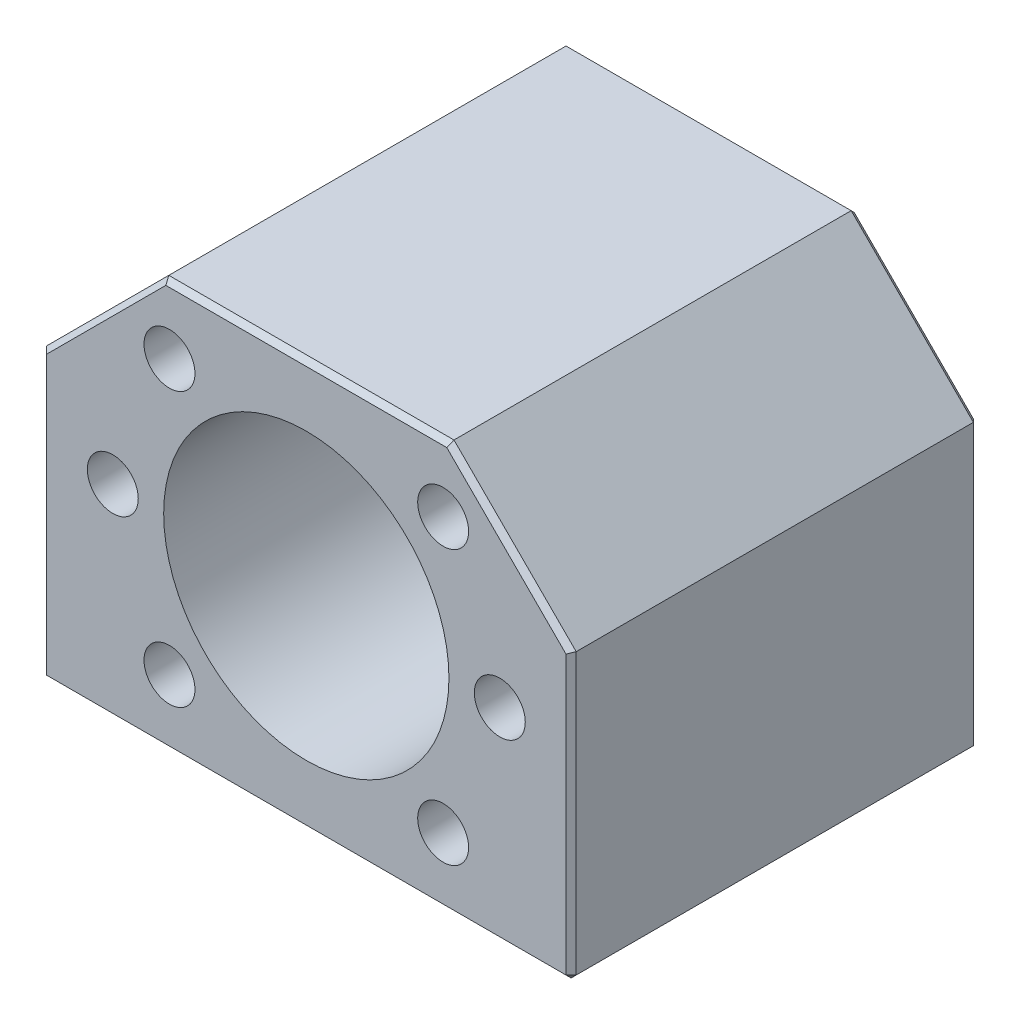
ISO-10303-21;
HEADER;
FILE_DESCRIPTION(('STEP AP214'),'2;1');
FILE_NAME('part.step','',(''),(''),'','','');
FILE_SCHEMA(('AUTOMOTIVE_DESIGN { 1 0 10303 214 1 1 1 1 }'));
ENDSEC;
DATA;
#1=APPLICATION_CONTEXT('core data for automotive mechanical design processes');
#2=APPLICATION_PROTOCOL_DEFINITION('international standard','automotive_design',2000,#1);
#3=PRODUCT_CONTEXT('',#1,'mechanical');
#4=PRODUCT('Part','Part','',(#3));
#5=PRODUCT_RELATED_PRODUCT_CATEGORY('part','',(#4));
#6=PRODUCT_DEFINITION_FORMATION('','',#4);
#7=PRODUCT_DEFINITION_CONTEXT('part definition',#1,'design');
#8=PRODUCT_DEFINITION('design','',#6,#7);
#9=PRODUCT_DEFINITION_SHAPE('','',#8);
#10=(LENGTH_UNIT() NAMED_UNIT(*) SI_UNIT(.MILLI.,.METRE.));
#11=(NAMED_UNIT(*) PLANE_ANGLE_UNIT() SI_UNIT($,.RADIAN.));
#12=(NAMED_UNIT(*) SI_UNIT($,.STERADIAN.) SOLID_ANGLE_UNIT());
#13=UNCERTAINTY_MEASURE_WITH_UNIT(LENGTH_MEASURE(1.E-05),#10,'distance_accuracy_value','');
#14=(GEOMETRIC_REPRESENTATION_CONTEXT(3) GLOBAL_UNCERTAINTY_ASSIGNED_CONTEXT((#13)) GLOBAL_UNIT_ASSIGNED_CONTEXT((#10,
#11,#12)) REPRESENTATION_CONTEXT('',''));
#15=CARTESIAN_POINT('',(0.,0.,0.));
#16=DIRECTION('',(0.,0.,1.));
#17=DIRECTION('',(1.,0.,0.));
#18=AXIS2_PLACEMENT_3D('',#15,#16,#17);
#19=CARTESIAN_POINT('',(-13.,19.75,-39.75));
#20=DIRECTION('',(0.,0.707106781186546,-0.707106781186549));
#21=DIRECTION('',(-1.,0.,0.));
#22=AXIS2_PLACEMENT_3D('',#19,#20,#21);
#23=PLANE('',#22);
#24=DIRECTION('',(-1.,0.,0.));
#25=VECTOR('',#24,1.);
#26=CARTESIAN_POINT('',(-13.,19.5,-40.));
#27=LINE('',#26,#25);
#28=CARTESIAN_POINT('',(13.7928932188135,19.5,-40.));
#29=VERTEX_POINT('',#28);
#30=CARTESIAN_POINT('',(-13.7928932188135,19.5,-40.));
#31=VERTEX_POINT('',#30);
#32=EDGE_CURVE('E9',#29,#31,#27,.T.);
#33=ORIENTED_EDGE('',*,*,#32,.T.);
#34=DIRECTION('',(-0.281084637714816,0.67859834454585,0.678598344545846));
#35=VECTOR('',#34,1.);
#36=CARTESIAN_POINT('',(-13.7928932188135,19.5,-40.));
#37=LINE('',#36,#35);
#38=CARTESIAN_POINT('',(-14.,20.,-39.5));
#39=VERTEX_POINT('',#38);
#40=EDGE_CURVE('E26',#31,#39,#37,.T.);
#41=ORIENTED_EDGE('',*,*,#40,.T.);
#42=DIRECTION('',(1.,0.,0.));
#43=VECTOR('',#42,1.);
#44=CARTESIAN_POINT('',(-13.,20.,-39.5));
#45=LINE('',#44,#43);
#46=CARTESIAN_POINT('',(14.,20.,-39.5));
#47=VERTEX_POINT('',#46);
#48=EDGE_CURVE('E500',#39,#47,#45,.T.);
#49=ORIENTED_EDGE('',*,*,#48,.T.);
#50=DIRECTION('',(0.281084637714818,0.678598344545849,0.678598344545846));
#51=VECTOR('',#50,1.);
#52=CARTESIAN_POINT('',(13.7928932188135,19.5,-40.));
#53=LINE('',#52,#51);
#54=EDGE_CURVE('E425',#29,#47,#53,.T.);
#55=ORIENTED_EDGE('',*,*,#54,.F.);
#56=EDGE_LOOP('',(#33,#41,#49,#55));
#57=FACE_BOUND('',#56,.T.);
#58=ADVANCED_FACE('F15',(#57),#23,.T.);
#59=CARTESIAN_POINT('',(-13.,19.75,-0.25));
#60=DIRECTION('',(0.,0.707106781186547,0.707106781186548));
#61=DIRECTION('',(1.,0.,0.));
#62=AXIS2_PLACEMENT_3D('',#59,#60,#61);
#63=PLANE('',#62);
#64=DIRECTION('',(1.,0.,0.));
#65=VECTOR('',#64,1.);
#66=CARTESIAN_POINT('',(-13.,19.5,0.));
#67=LINE('',#66,#65);
#68=CARTESIAN_POINT('',(-13.7928932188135,19.5,0.));
#69=VERTEX_POINT('',#68);
#70=CARTESIAN_POINT('',(13.7928932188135,19.5,0.));
#71=VERTEX_POINT('',#70);
#72=EDGE_CURVE('E458',#69,#71,#67,.T.);
#73=ORIENTED_EDGE('',*,*,#72,.T.);
#74=DIRECTION('',(0.281084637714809,0.678598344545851,-0.678598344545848));
#75=VECTOR('',#74,1.);
#76=CARTESIAN_POINT('',(13.7928932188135,19.5,0.));
#77=LINE('',#76,#75);
#78=CARTESIAN_POINT('',(14.,20.,-0.5));
#79=VERTEX_POINT('',#78);
#80=EDGE_CURVE('E454',#71,#79,#77,.T.);
#81=ORIENTED_EDGE('',*,*,#80,.T.);
#82=DIRECTION('',(-1.,0.,0.));
#83=VECTOR('',#82,1.);
#84=CARTESIAN_POINT('',(-13.,20.,-0.5));
#85=LINE('',#84,#83);
#86=CARTESIAN_POINT('',(-14.,20.,-0.5));
#87=VERTEX_POINT('',#86);
#88=EDGE_CURVE('E329',#79,#87,#85,.T.);
#89=ORIENTED_EDGE('',*,*,#88,.T.);
#90=DIRECTION('',(-0.281084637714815,0.678598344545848,-0.678598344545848));
#91=VECTOR('',#90,1.);
#92=CARTESIAN_POINT('',(-13.7928932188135,19.5,0.));
#93=LINE('',#92,#91);
#94=EDGE_CURVE('E357',#69,#87,#93,.T.);
#95=ORIENTED_EDGE('',*,*,#94,.F.);
#96=EDGE_LOOP('',(#73,#81,#89,#95));
#97=FACE_BOUND('',#96,.T.);
#98=ADVANCED_FACE('F1132',(#97),#63,.T.);
#99=CARTESIAN_POINT('',(-18.3232233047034,15.3232233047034,-39.75));
#100=DIRECTION('',(-0.5,0.5,-0.707106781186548));
#101=DIRECTION('',(-0.816496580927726,0.,0.577350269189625));
#102=AXIS2_PLACEMENT_3D('',#99,#100,#101);
#103=PLANE('',#102);
#104=DIRECTION('',(-0.707106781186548,-0.707106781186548,0.));
#105=VECTOR('',#104,1.);
#106=CARTESIAN_POINT('',(-18.1464466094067,15.1464466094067,-40.));
#107=LINE('',#106,#105);
#108=CARTESIAN_POINT('',(-25.5,7.79289321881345,-40.));
#109=VERTEX_POINT('',#108);
#110=EDGE_CURVE('E326',#31,#109,#107,.T.);
#111=ORIENTED_EDGE('',*,*,#110,.T.);
#112=DIRECTION('',(-0.678598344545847,0.281084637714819,0.678598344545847));
#113=VECTOR('',#112,1.);
#114=CARTESIAN_POINT('',(-25.5,7.79289321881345,-40.));
#115=LINE('',#114,#113);
#116=CARTESIAN_POINT('',(-26.,8.,-39.5));
#117=VERTEX_POINT('',#116);
#118=EDGE_CURVE('E330',#109,#117,#115,.T.);
#119=ORIENTED_EDGE('',*,*,#118,.T.);
#120=DIRECTION('',(0.707106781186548,0.707106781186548,0.));
#121=VECTOR('',#120,1.);
#122=CARTESIAN_POINT('',(-18.5,15.5,-39.5));
#123=LINE('',#122,#121);
#124=EDGE_CURVE('E434',#117,#39,#123,.T.);
#125=ORIENTED_EDGE('',*,*,#124,.T.);
#126=ORIENTED_EDGE('',*,*,#40,.F.);
#127=EDGE_LOOP('',(#111,#119,#125,#126));
#128=FACE_BOUND('',#127,.T.);
#129=ADVANCED_FACE('F696',(#128),#103,.T.);
#130=CARTESIAN_POINT('',(18.3232233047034,15.3232233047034,-0.25));
#131=DIRECTION('',(0.5,0.5,0.707106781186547));
#132=DIRECTION('',(0.707106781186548,-0.707106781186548,0.));
#133=AXIS2_PLACEMENT_3D('',#130,#131,#132);
#134=PLANE('',#133);
#135=DIRECTION('',(0.707106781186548,-0.707106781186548,0.));
#136=VECTOR('',#135,1.);
#137=CARTESIAN_POINT('',(18.1464466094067,15.1464466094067,0.));
#138=LINE('',#137,#136);
#139=CARTESIAN_POINT('',(25.5,7.79289321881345,0.));
#140=VERTEX_POINT('',#139);
#141=EDGE_CURVE('E430',#71,#140,#138,.T.);
#142=ORIENTED_EDGE('',*,*,#141,.T.);
#143=DIRECTION('',(0.678598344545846,0.281084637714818,-0.678598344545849));
#144=VECTOR('',#143,1.);
#145=CARTESIAN_POINT('',(25.5,7.79289321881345,0.));
#146=LINE('',#145,#144);
#147=CARTESIAN_POINT('',(26.,8.,-0.5));
#148=VERTEX_POINT('',#147);
#149=EDGE_CURVE('E435',#140,#148,#146,.T.);
#150=ORIENTED_EDGE('',*,*,#149,.T.);
#151=DIRECTION('',(-0.707106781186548,0.707106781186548,0.));
#152=VECTOR('',#151,1.);
#153=CARTESIAN_POINT('',(18.5,15.5,-0.5));
#154=LINE('',#153,#152);
#155=EDGE_CURVE('E285',#148,#79,#154,.T.);
#156=ORIENTED_EDGE('',*,*,#155,.T.);
#157=ORIENTED_EDGE('',*,*,#80,.F.);
#158=EDGE_LOOP('',(#142,#150,#156,#157));
#159=FACE_BOUND('',#158,.T.);
#160=ADVANCED_FACE('F1121',(#159),#134,.T.);
#161=CARTESIAN_POINT('',(25.5,-20.,-39.5));
#162=DIRECTION('',(0.577350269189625,-0.577350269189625,-0.577350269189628));
#163=DIRECTION('',(0.,-0.70710678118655,0.707106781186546));
#164=AXIS2_PLACEMENT_3D('',#161,#162,#163);
#165=PLANE('',#164);
#166=DIRECTION('',(-0.707106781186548,0.,-0.707106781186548));
#167=VECTOR('',#166,1.);
#168=CARTESIAN_POINT('',(26.,-19.5,-39.5));
#169=LINE('',#168,#167);
#170=CARTESIAN_POINT('',(26.,-19.5,-39.5));
#171=VERTEX_POINT('',#170);
#172=CARTESIAN_POINT('',(25.5,-19.5,-40.));
#173=VERTEX_POINT('',#172);
#174=EDGE_CURVE('E413',#171,#173,#169,.T.);
#175=ORIENTED_EDGE('',*,*,#174,.F.);
#176=DIRECTION('',(0.707106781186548,0.707106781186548,0.));
#177=VECTOR('',#176,1.);
#178=CARTESIAN_POINT('',(25.5,-20.,-39.5));
#179=LINE('',#178,#177);
#180=CARTESIAN_POINT('',(25.5,-20.,-39.5));
#181=VERTEX_POINT('',#180);
#182=EDGE_CURVE('E661',#181,#171,#179,.T.);
#183=ORIENTED_EDGE('',*,*,#182,.F.);
#184=DIRECTION('',(0.,-0.707106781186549,0.707106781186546));
#185=VECTOR('',#184,1.);
#186=CARTESIAN_POINT('',(25.5,-19.5,-40.));
#187=LINE('',#186,#185);
#188=EDGE_CURVE('E320',#173,#181,#187,.T.);
#189=ORIENTED_EDGE('',*,*,#188,.F.);
#190=EDGE_LOOP('',(#175,#183,#189));
#191=FACE_BOUND('',#190,.T.);
#192=ADVANCED_FACE('F666',(#191),#165,.T.);
#193=CARTESIAN_POINT('',(-26.,-19.5,-39.5));
#194=DIRECTION('',(-0.577350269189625,-0.577350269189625,-0.577350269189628));
#195=DIRECTION('',(0.,-0.70710678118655,0.707106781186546));
#196=AXIS2_PLACEMENT_3D('',#193,#194,#195);
#197=PLANE('',#196);
#198=DIRECTION('',(0.,0.707106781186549,-0.707106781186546));
#199=VECTOR('',#198,1.);
#200=CARTESIAN_POINT('',(-25.5,-20.,-39.5));
#201=LINE('',#200,#199);
#202=CARTESIAN_POINT('',(-25.5,-20.,-39.5));
#203=VERTEX_POINT('',#202);
#204=CARTESIAN_POINT('',(-25.5,-19.5,-40.));
#205=VERTEX_POINT('',#204);
#206=EDGE_CURVE('E319',#203,#205,#201,.T.);
#207=ORIENTED_EDGE('',*,*,#206,.F.);
#208=DIRECTION('',(0.707106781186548,-0.707106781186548,0.));
#209=VECTOR('',#208,1.);
#210=CARTESIAN_POINT('',(-26.,-19.5,-39.5));
#211=LINE('',#210,#209);
#212=CARTESIAN_POINT('',(-26.,-19.5,-39.5));
#213=VERTEX_POINT('',#212);
#214=EDGE_CURVE('E379',#213,#203,#211,.T.);
#215=ORIENTED_EDGE('',*,*,#214,.F.);
#216=DIRECTION('',(-0.707106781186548,0.,0.707106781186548));
#217=VECTOR('',#216,1.);
#218=CARTESIAN_POINT('',(-25.5,-19.5,-40.));
#219=LINE('',#218,#217);
#220=EDGE_CURVE('E501',#205,#213,#219,.T.);
#221=ORIENTED_EDGE('',*,*,#220,.F.);
#222=EDGE_LOOP('',(#207,#215,#221));
#223=FACE_BOUND('',#222,.T.);
#224=ADVANCED_FACE('F681',(#223),#197,.T.);
#225=CARTESIAN_POINT('',(25.5,-20.,-0.5));
#226=DIRECTION('',(0.577350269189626,-0.577350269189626,0.577350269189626));
#227=DIRECTION('',(0.,-0.707106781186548,-0.707106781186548));
#228=AXIS2_PLACEMENT_3D('',#225,#226,#227);
#229=PLANE('',#228);
#230=DIRECTION('',(0.707106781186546,0.,-0.707106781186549));
#231=VECTOR('',#230,1.);
#232=CARTESIAN_POINT('',(25.5,-19.5,0.));
#233=LINE('',#232,#231);
#234=CARTESIAN_POINT('',(25.5,-19.5,0.));
#235=VERTEX_POINT('',#234);
#236=CARTESIAN_POINT('',(26.,-19.5,-0.5));
#237=VERTEX_POINT('',#236);
#238=EDGE_CURVE('E343',#235,#237,#233,.T.);
#239=ORIENTED_EDGE('',*,*,#238,.F.);
#240=DIRECTION('',(0.,0.707106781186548,0.707106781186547));
#241=VECTOR('',#240,1.);
#242=CARTESIAN_POINT('',(25.5,-20.,-0.5));
#243=LINE('',#242,#241);
#244=CARTESIAN_POINT('',(25.5,-20.,-0.5));
#245=VERTEX_POINT('',#244);
#246=EDGE_CURVE('E509',#245,#235,#243,.T.);
#247=ORIENTED_EDGE('',*,*,#246,.F.);
#248=DIRECTION('',(-0.707106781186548,-0.707106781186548,0.));
#249=VECTOR('',#248,1.);
#250=CARTESIAN_POINT('',(26.,-19.5,-0.5));
#251=LINE('',#250,#249);
#252=EDGE_CURVE('E519',#237,#245,#251,.T.);
#253=ORIENTED_EDGE('',*,*,#252,.F.);
#254=EDGE_LOOP('',(#239,#247,#253));
#255=FACE_BOUND('',#254,.T.);
#256=ADVANCED_FACE('F1194',(#255),#229,.T.);
#257=CARTESIAN_POINT('',(-26.,-19.5,-0.5));
#258=DIRECTION('',(-0.577350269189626,-0.577350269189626,0.577350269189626));
#259=DIRECTION('',(-0.707106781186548,0.707106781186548,0.));
#260=AXIS2_PLACEMENT_3D('',#257,#258,#259);
#261=PLANE('',#260);
#262=DIRECTION('',(0.,-0.707106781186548,-0.707106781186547));
#263=VECTOR('',#262,1.);
#264=CARTESIAN_POINT('',(-25.5,-19.5,0.));
#265=LINE('',#264,#263);
#266=CARTESIAN_POINT('',(-25.5,-19.5,0.));
#267=VERTEX_POINT('',#266);
#268=CARTESIAN_POINT('',(-25.5,-20.,-0.5));
#269=VERTEX_POINT('',#268);
#270=EDGE_CURVE('E19',#267,#269,#265,.T.);
#271=ORIENTED_EDGE('',*,*,#270,.F.);
#272=DIRECTION('',(0.707106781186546,0.,0.707106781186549));
#273=VECTOR('',#272,1.);
#274=CARTESIAN_POINT('',(-26.,-19.5,-0.5));
#275=LINE('',#274,#273);
#276=CARTESIAN_POINT('',(-26.,-19.5,-0.5));
#277=VERTEX_POINT('',#276);
#278=EDGE_CURVE('E337',#277,#267,#275,.T.);
#279=ORIENTED_EDGE('',*,*,#278,.F.);
#280=DIRECTION('',(-0.707106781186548,0.707106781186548,0.));
#281=VECTOR('',#280,1.);
#282=CARTESIAN_POINT('',(-25.5,-20.,-0.5));
#283=LINE('',#282,#281);
#284=EDGE_CURVE('E186',#269,#277,#283,.T.);
#285=ORIENTED_EDGE('',*,*,#284,.F.);
#286=EDGE_LOOP('',(#271,#279,#285));
#287=FACE_BOUND('',#286,.T.);
#288=ADVANCED_FACE('F1190',(#287),#261,.T.);
#289=CARTESIAN_POINT('',(-25.75,-10.,-0.25));
#290=DIRECTION('',(-0.707106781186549,0.,0.707106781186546));
#291=DIRECTION('',(0.,1.,0.));
#292=AXIS2_PLACEMENT_3D('',#289,#290,#291);
#293=PLANE('',#292);
#294=DIRECTION('',(0.,-1.,0.));
#295=VECTOR('',#294,1.);
#296=CARTESIAN_POINT('',(-26.,-10.,-0.5));
#297=LINE('',#296,#295);
#298=CARTESIAN_POINT('',(-26.,8.,-0.5));
#299=VERTEX_POINT('',#298);
#300=EDGE_CURVE('E341',#299,#277,#297,.T.);
#301=ORIENTED_EDGE('',*,*,#300,.T.);
#302=ORIENTED_EDGE('',*,*,#278,.T.);
#303=DIRECTION('',(0.,1.,0.));
#304=VECTOR('',#303,1.);
#305=CARTESIAN_POINT('',(-25.5,-10.,0.));
#306=LINE('',#305,#304);
#307=CARTESIAN_POINT('',(-25.5,7.79289321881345,0.));
#308=VERTEX_POINT('',#307);
#309=EDGE_CURVE('E342',#267,#308,#306,.T.);
#310=ORIENTED_EDGE('',*,*,#309,.T.);
#311=DIRECTION('',(-0.678598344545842,0.281084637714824,-0.678598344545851));
#312=VECTOR('',#311,1.);
#313=CARTESIAN_POINT('',(-25.5,7.79289321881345,0.));
#314=LINE('',#313,#312);
#315=EDGE_CURVE('E466',#308,#299,#314,.T.);
#316=ORIENTED_EDGE('',*,*,#315,.T.);
#317=EDGE_LOOP('',(#301,#302,#310,#316));
#318=FACE_BOUND('',#317,.T.);
#319=ADVANCED_FACE('F1193',(#318),#293,.T.);
#320=CARTESIAN_POINT('',(-25.75,-19.75,0.));
#321=DIRECTION('',(-0.707106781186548,-0.707106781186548,0.));
#322=DIRECTION('',(-0.707106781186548,0.707106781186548,0.));
#323=AXIS2_PLACEMENT_3D('',#320,#321,#322);
#324=PLANE('',#323);
#325=ORIENTED_EDGE('',*,*,#214,.T.);
#326=DIRECTION('',(0.,0.,1.));
#327=VECTOR('',#326,1.);
#328=CARTESIAN_POINT('',(-25.5,-20.,0.));
#329=LINE('',#328,#327);
#330=EDGE_CURVE('E377',#203,#269,#329,.T.);
#331=ORIENTED_EDGE('',*,*,#330,.T.);
#332=ORIENTED_EDGE('',*,*,#284,.T.);
#333=DIRECTION('',(0.,0.,-1.));
#334=VECTOR('',#333,1.);
#335=CARTESIAN_POINT('',(-26.,-19.5,0.));
#336=LINE('',#335,#334);
#337=EDGE_CURVE('E506',#277,#213,#336,.T.);
#338=ORIENTED_EDGE('',*,*,#337,.T.);
#339=EDGE_LOOP('',(#325,#331,#332,#338));
#340=FACE_BOUND('',#339,.T.);
#341=ADVANCED_FACE('F676',(#340),#324,.T.);
#342=CARTESIAN_POINT('',(13.,-19.75,-0.25));
#343=DIRECTION('',(0.,-0.707106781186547,0.707106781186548));
#344=DIRECTION('',(-1.,0.,0.));
#345=AXIS2_PLACEMENT_3D('',#342,#343,#344);
#346=PLANE('',#345);
#347=ORIENTED_EDGE('',*,*,#246,.T.);
#348=DIRECTION('',(-1.,0.,0.));
#349=VECTOR('',#348,1.);
#350=CARTESIAN_POINT('',(13.,-19.5,0.));
#351=LINE('',#350,#349);
#352=EDGE_CURVE('E544',#235,#267,#351,.T.);
#353=ORIENTED_EDGE('',*,*,#352,.T.);
#354=ORIENTED_EDGE('',*,*,#270,.T.);
#355=DIRECTION('',(1.,0.,0.));
#356=VECTOR('',#355,1.);
#357=CARTESIAN_POINT('',(13.,-20.,-0.5));
#358=LINE('',#357,#356);
#359=EDGE_CURVE('E669',#269,#245,#358,.T.);
#360=ORIENTED_EDGE('',*,*,#359,.T.);
#361=EDGE_LOOP('',(#347,#353,#354,#360));
#362=FACE_BOUND('',#361,.T.);
#363=ADVANCED_FACE('F1206',(#362),#346,.T.);
#364=CARTESIAN_POINT('',(25.75,-19.75,0.));
#365=DIRECTION('',(0.707106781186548,-0.707106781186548,0.));
#366=DIRECTION('',(0.,0.,-1.));
#367=AXIS2_PLACEMENT_3D('',#364,#365,#366);
#368=PLANE('',#367);
#369=ORIENTED_EDGE('',*,*,#182,.T.);
#370=DIRECTION('',(0.,0.,1.));
#371=VECTOR('',#370,1.);
#372=CARTESIAN_POINT('',(26.,-19.5,0.));
#373=LINE('',#372,#371);
#374=EDGE_CURVE('E571',#171,#237,#373,.T.);
#375=ORIENTED_EDGE('',*,*,#374,.T.);
#376=ORIENTED_EDGE('',*,*,#252,.T.);
#377=DIRECTION('',(0.,0.,-1.));
#378=VECTOR('',#377,1.);
#379=CARTESIAN_POINT('',(25.5,-20.,0.));
#380=LINE('',#379,#378);
#381=EDGE_CURVE('E486',#245,#181,#380,.T.);
#382=ORIENTED_EDGE('',*,*,#381,.T.);
#383=EDGE_LOOP('',(#369,#375,#376,#382));
#384=FACE_BOUND('',#383,.T.);
#385=ADVANCED_FACE('F659',(#384),#368,.T.);
#386=CARTESIAN_POINT('',(25.75,10.,-0.25));
#387=DIRECTION('',(0.707106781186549,0.,0.707106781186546));
#388=DIRECTION('',(0.,-1.,0.));
#389=AXIS2_PLACEMENT_3D('',#386,#387,#388);
#390=PLANE('',#389);
#391=DIRECTION('',(0.,-1.,0.));
#392=VECTOR('',#391,1.);
#393=CARTESIAN_POINT('',(25.5,10.,0.));
#394=LINE('',#393,#392);
#395=EDGE_CURVE('E346',#140,#235,#394,.T.);
#396=ORIENTED_EDGE('',*,*,#395,.T.);
#397=ORIENTED_EDGE('',*,*,#238,.T.);
#398=DIRECTION('',(0.,1.,0.));
#399=VECTOR('',#398,1.);
#400=CARTESIAN_POINT('',(26.,10.,-0.5));
#401=LINE('',#400,#399);
#402=EDGE_CURVE('E347',#237,#148,#401,.T.);
#403=ORIENTED_EDGE('',*,*,#402,.T.);
#404=ORIENTED_EDGE('',*,*,#149,.F.);
#405=EDGE_LOOP('',(#396,#397,#403,#404));
#406=FACE_BOUND('',#405,.T.);
#407=ADVANCED_FACE('F1488',(#406),#390,.T.);
#408=CARTESIAN_POINT('',(-25.75,-10.,-39.75));
#409=DIRECTION('',(-0.707106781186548,0.,-0.707106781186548));
#410=DIRECTION('',(-0.707106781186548,0.,0.707106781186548));
#411=AXIS2_PLACEMENT_3D('',#408,#409,#410);
#412=PLANE('',#411);
#413=DIRECTION('',(0.,-1.,0.));
#414=VECTOR('',#413,1.);
#415=CARTESIAN_POINT('',(-25.5,-10.,-40.));
#416=LINE('',#415,#414);
#417=EDGE_CURVE('E405',#109,#205,#416,.T.);
#418=ORIENTED_EDGE('',*,*,#417,.T.);
#419=ORIENTED_EDGE('',*,*,#220,.T.);
#420=DIRECTION('',(0.,1.,0.));
#421=VECTOR('',#420,1.);
#422=CARTESIAN_POINT('',(-26.,-10.,-39.5));
#423=LINE('',#422,#421);
#424=EDGE_CURVE('E505',#213,#117,#423,.T.);
#425=ORIENTED_EDGE('',*,*,#424,.T.);
#426=ORIENTED_EDGE('',*,*,#118,.F.);
#427=EDGE_LOOP('',(#418,#419,#425,#426));
#428=FACE_BOUND('',#427,.T.);
#429=ADVANCED_FACE('F690',(#428),#412,.T.);
#430=CARTESIAN_POINT('',(13.,-19.75,-39.75));
#431=DIRECTION('',(0.,-0.707106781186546,-0.707106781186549));
#432=DIRECTION('',(0.,-0.707106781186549,0.707106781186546));
#433=AXIS2_PLACEMENT_3D('',#430,#431,#432);
#434=PLANE('',#433);
#435=ORIENTED_EDGE('',*,*,#206,.T.);
#436=DIRECTION('',(1.,0.,0.));
#437=VECTOR('',#436,1.);
#438=CARTESIAN_POINT('',(13.,-19.5,-40.));
#439=LINE('',#438,#437);
#440=EDGE_CURVE('E315',#205,#173,#439,.T.);
#441=ORIENTED_EDGE('',*,*,#440,.T.);
#442=ORIENTED_EDGE('',*,*,#188,.T.);
#443=DIRECTION('',(-1.,0.,0.));
#444=VECTOR('',#443,1.);
#445=CARTESIAN_POINT('',(13.,-20.,-39.5));
#446=LINE('',#445,#444);
#447=EDGE_CURVE('E459',#181,#203,#446,.T.);
#448=ORIENTED_EDGE('',*,*,#447,.T.);
#449=EDGE_LOOP('',(#435,#441,#442,#448));
#450=FACE_BOUND('',#449,.T.);
#451=ADVANCED_FACE('F648',(#450),#434,.T.);
#452=CARTESIAN_POINT('',(-18.3232233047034,15.3232233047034,-0.25));
#453=DIRECTION('',(-0.5,0.5,0.707106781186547));
#454=DIRECTION('',(0.707106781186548,0.707106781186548,0.));
#455=AXIS2_PLACEMENT_3D('',#452,#453,#454);
#456=PLANE('',#455);
#457=DIRECTION('',(-0.707106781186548,-0.707106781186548,0.));
#458=VECTOR('',#457,1.);
#459=CARTESIAN_POINT('',(-18.5,15.5,-0.5));
#460=LINE('',#459,#458);
#461=EDGE_CURVE('E356',#87,#299,#460,.T.);
#462=ORIENTED_EDGE('',*,*,#461,.T.);
#463=ORIENTED_EDGE('',*,*,#315,.F.);
#464=DIRECTION('',(0.707106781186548,0.707106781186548,0.));
#465=VECTOR('',#464,1.);
#466=CARTESIAN_POINT('',(-18.1464466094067,15.1464466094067,0.));
#467=LINE('',#466,#465);
#468=EDGE_CURVE('E352',#308,#69,#467,.T.);
#469=ORIENTED_EDGE('',*,*,#468,.T.);
#470=ORIENTED_EDGE('',*,*,#94,.T.);
#471=EDGE_LOOP('',(#462,#463,#469,#470));
#472=FACE_BOUND('',#471,.T.);
#473=ADVANCED_FACE('F1471',(#472),#456,.T.);
#474=CARTESIAN_POINT('',(25.75,10.,-39.75));
#475=DIRECTION('',(0.707106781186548,0.,-0.707106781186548));
#476=DIRECTION('',(0.,-1.,0.));
#477=AXIS2_PLACEMENT_3D('',#474,#475,#476);
#478=PLANE('',#477);
#479=DIRECTION('',(0.,-1.,0.));
#480=VECTOR('',#479,1.);
#481=CARTESIAN_POINT('',(26.,10.,-39.5));
#482=LINE('',#481,#480);
#483=CARTESIAN_POINT('',(26.,8.,-39.5));
#484=VERTEX_POINT('',#483);
#485=EDGE_CURVE('E376',#484,#171,#482,.T.);
#486=ORIENTED_EDGE('',*,*,#485,.T.);
#487=ORIENTED_EDGE('',*,*,#174,.T.);
#488=DIRECTION('',(0.,1.,0.));
#489=VECTOR('',#488,1.);
#490=CARTESIAN_POINT('',(25.5,10.,-40.));
#491=LINE('',#490,#489);
#492=CARTESIAN_POINT('',(25.5,7.79289321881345,-40.));
#493=VERTEX_POINT('',#492);
#494=EDGE_CURVE('E417',#173,#493,#491,.T.);
#495=ORIENTED_EDGE('',*,*,#494,.T.);
#496=DIRECTION('',(0.678598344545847,0.281084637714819,0.678598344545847));
#497=VECTOR('',#496,1.);
#498=CARTESIAN_POINT('',(25.5,7.79289321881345,-40.));
#499=LINE('',#498,#497);
#500=EDGE_CURVE('E385',#493,#484,#499,.T.);
#501=ORIENTED_EDGE('',*,*,#500,.T.);
#502=EDGE_LOOP('',(#486,#487,#495,#501));
#503=FACE_BOUND('',#502,.T.);
#504=ADVANCED_FACE('F1145',(#503),#478,.T.);
#505=CARTESIAN_POINT('',(18.3232233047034,15.3232233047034,-39.75));
#506=DIRECTION('',(0.5,0.5,-0.707106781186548));
#507=DIRECTION('',(0.,-0.816496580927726,-0.577350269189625));
#508=AXIS2_PLACEMENT_3D('',#505,#506,#507);
#509=PLANE('',#508);
#510=DIRECTION('',(0.707106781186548,-0.707106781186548,0.));
#511=VECTOR('',#510,1.);
#512=CARTESIAN_POINT('',(18.5,15.5,-39.5));
#513=LINE('',#512,#511);
#514=EDGE_CURVE('E381',#47,#484,#513,.T.);
#515=ORIENTED_EDGE('',*,*,#514,.T.);
#516=ORIENTED_EDGE('',*,*,#500,.F.);
#517=DIRECTION('',(-0.707106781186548,0.707106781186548,0.));
#518=VECTOR('',#517,1.);
#519=CARTESIAN_POINT('',(18.1464466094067,15.1464466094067,-40.));
#520=LINE('',#519,#518);
#521=EDGE_CURVE('E386',#493,#29,#520,.T.);
#522=ORIENTED_EDGE('',*,*,#521,.T.);
#523=ORIENTED_EDGE('',*,*,#54,.T.);
#524=EDGE_LOOP('',(#515,#516,#522,#523));
#525=FACE_BOUND('',#524,.T.);
#526=ADVANCED_FACE('F1142',(#525),#509,.T.);
#527=CARTESIAN_POINT('',(-20.,14.,0.));
#528=DIRECTION('',(-0.707106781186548,0.707106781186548,0.));
#529=DIRECTION('',(0.,0.,1.));
#530=AXIS2_PLACEMENT_3D('',#527,#528,#529);
#531=PLANE('',#530);
#532=ORIENTED_EDGE('',*,*,#461,.F.);
#533=DIRECTION('',(0.,0.,-1.));
#534=VECTOR('',#533,1.);
#535=CARTESIAN_POINT('',(-14.,20.,0.));
#536=LINE('',#535,#534);
#537=EDGE_CURVE('E429',#87,#39,#536,.T.);
#538=ORIENTED_EDGE('',*,*,#537,.T.);
#539=ORIENTED_EDGE('',*,*,#124,.F.);
#540=DIRECTION('',(0.,0.,1.));
#541=VECTOR('',#540,1.);
#542=CARTESIAN_POINT('',(-26.,8.,0.));
#543=LINE('',#542,#541);
#544=EDGE_CURVE('E532',#117,#299,#543,.T.);
#545=ORIENTED_EDGE('',*,*,#544,.T.);
#546=EDGE_LOOP('',(#532,#538,#539,#545));
#547=FACE_BOUND('',#546,.T.);
#548=ADVANCED_FACE('F693',(#547),#531,.T.);
#549=CARTESIAN_POINT('',(-26.,20.,0.));
#550=DIRECTION('',(0.,1.,0.));
#551=DIRECTION('',(1.,0.,0.));
#552=AXIS2_PLACEMENT_3D('',#549,#550,#551);
#553=PLANE('',#552);
#554=ORIENTED_EDGE('',*,*,#88,.F.);
#555=DIRECTION('',(0.,0.,1.));
#556=VECTOR('',#555,1.);
#557=CARTESIAN_POINT('',(14.,20.,0.));
#558=LINE('',#557,#556);
#559=EDGE_CURVE('E411',#47,#79,#558,.T.);
#560=ORIENTED_EDGE('',*,*,#559,.F.);
#561=ORIENTED_EDGE('',*,*,#48,.F.);
#562=ORIENTED_EDGE('',*,*,#537,.F.);
#563=EDGE_LOOP('',(#554,#560,#561,#562));
#564=FACE_BOUND('',#563,.T.);
#565=ADVANCED_FACE('F1128',(#564),#553,.T.);
#566=CARTESIAN_POINT('',(20.,14.,0.));
#567=DIRECTION('',(0.707106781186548,0.707106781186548,0.));
#568=DIRECTION('',(0.,0.,-1.));
#569=AXIS2_PLACEMENT_3D('',#566,#567,#568);
#570=PLANE('',#569);
#571=ORIENTED_EDGE('',*,*,#155,.F.);
#572=DIRECTION('',(0.,0.,-1.));
#573=VECTOR('',#572,1.);
#574=CARTESIAN_POINT('',(26.,8.,0.));
#575=LINE('',#574,#573);
#576=EDGE_CURVE('E536',#148,#484,#575,.T.);
#577=ORIENTED_EDGE('',*,*,#576,.T.);
#578=ORIENTED_EDGE('',*,*,#514,.F.);
#579=ORIENTED_EDGE('',*,*,#559,.T.);
#580=EDGE_LOOP('',(#571,#577,#578,#579));
#581=FACE_BOUND('',#580,.T.);
#582=ADVANCED_FACE('F1136',(#581),#570,.T.);
#583=CARTESIAN_POINT('',(26.,20.,0.));
#584=DIRECTION('',(1.,0.,0.));
#585=DIRECTION('',(0.,1.,0.));
#586=AXIS2_PLACEMENT_3D('',#583,#584,#585);
#587=PLANE('',#586);
#588=ORIENTED_EDGE('',*,*,#402,.F.);
#589=ORIENTED_EDGE('',*,*,#374,.F.);
#590=ORIENTED_EDGE('',*,*,#485,.F.);
#591=ORIENTED_EDGE('',*,*,#576,.F.);
#592=EDGE_LOOP('',(#588,#589,#590,#591));
#593=FACE_BOUND('',#592,.T.);
#594=ADVANCED_FACE('F1197',(#593),#587,.T.);
#595=CARTESIAN_POINT('',(0.,0.,-40.));
#596=DIRECTION('',(0.,0.,-1.));
#597=DIRECTION('',(0.,-1.,0.));
#598=AXIS2_PLACEMENT_3D('',#595,#596,#597);
#599=PLANE('',#598);
#600=ORIENTED_EDGE('',*,*,#32,.F.);
#601=ORIENTED_EDGE('',*,*,#521,.F.);
#602=ORIENTED_EDGE('',*,*,#494,.F.);
#603=ORIENTED_EDGE('',*,*,#440,.F.);
#604=ORIENTED_EDGE('',*,*,#417,.F.);
#605=ORIENTED_EDGE('',*,*,#110,.F.);
#606=EDGE_LOOP('',(#600,#601,#602,#603,#604,#605));
#607=FACE_BOUND('',#606,.T.);
#608=CARTESIAN_POINT('',(0.,0.,-40.));
#609=DIRECTION('',(0.,0.,1.));
#610=DIRECTION('',(1.,0.,0.));
#611=AXIS2_PLACEMENT_3D('',#608,#609,#610);
#612=CIRCLE('',#611,14.005);
#613=CARTESIAN_POINT('',(-14.005,0.,-40.));
#614=VERTEX_POINT('',#613);
#615=EDGE_CURVE('E407',#614,#614,#612,.T.);
#616=ORIENTED_EDGE('',*,*,#615,.T.);
#617=EDGE_LOOP('',(#616));
#618=FACE_BOUND('',#617,.T.);
#619=ADVANCED_FACE('F701',(#607,#618),#599,.T.);
#620=CARTESIAN_POINT('',(0.,0.,0.));
#621=DIRECTION('',(0.,0.,1.));
#622=DIRECTION('',(1.,0.,0.));
#623=AXIS2_PLACEMENT_3D('',#620,#621,#622);
#624=PLANE('',#623);
#625=ORIENTED_EDGE('',*,*,#309,.F.);
#626=ORIENTED_EDGE('',*,*,#352,.F.);
#627=ORIENTED_EDGE('',*,*,#395,.F.);
#628=ORIENTED_EDGE('',*,*,#141,.F.);
#629=ORIENTED_EDGE('',*,*,#72,.F.);
#630=ORIENTED_EDGE('',*,*,#468,.F.);
#631=EDGE_LOOP('',(#625,#626,#627,#628,#629,#630));
#632=FACE_BOUND('',#631,.T.);
#633=CARTESIAN_POINT('',(0.,0.,0.));
#634=DIRECTION('',(0.,0.,-1.));
#635=DIRECTION('',(1.,0.,0.));
#636=AXIS2_PLACEMENT_3D('',#633,#634,#635);
#637=CIRCLE('',#636,14.005);
#638=CARTESIAN_POINT('',(14.005,0.,0.));
#639=VERTEX_POINT('',#638);
#640=CARTESIAN_POINT('',(-14.005,0.,0.));
#641=VERTEX_POINT('',#640);
#642=EDGE_CURVE('E412',#639,#641,#637,.T.);
#643=ORIENTED_EDGE('',*,*,#642,.T.);
#644=CARTESIAN_POINT('',(0.,0.,0.));
#645=DIRECTION('',(0.,0.,-1.));
#646=DIRECTION('',(1.,0.,0.));
#647=AXIS2_PLACEMENT_3D('',#644,#645,#646);
#648=CIRCLE('',#647,14.005);
#649=EDGE_CURVE('E523',#641,#639,#648,.T.);
#650=ORIENTED_EDGE('',*,*,#649,.T.);
#651=EDGE_LOOP('',(#643,#650));
#652=FACE_BOUND('',#651,.T.);
#653=CARTESIAN_POINT('',(-13.4350288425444,13.4350288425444,0.));
#654=DIRECTION('',(0.,0.,-1.));
#655=DIRECTION('',(1.,0.,0.));
#656=AXIS2_PLACEMENT_3D('',#653,#654,#655);
#657=CIRCLE('',#656,2.5);
#658=CARTESIAN_POINT('',(-10.9350288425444,13.4350288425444,0.));
#659=VERTEX_POINT('',#658);
#660=CARTESIAN_POINT('',(-15.9350288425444,13.4350288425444,0.));
#661=VERTEX_POINT('',#660);
#662=EDGE_CURVE('E578',#659,#661,#657,.T.);
#663=ORIENTED_EDGE('',*,*,#662,.T.);
#664=CARTESIAN_POINT('',(-13.4350288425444,13.4350288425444,0.));
#665=DIRECTION('',(0.,0.,-1.));
#666=DIRECTION('',(1.,0.,0.));
#667=AXIS2_PLACEMENT_3D('',#664,#665,#666);
#668=CIRCLE('',#667,2.5);
#669=EDGE_CURVE('E557',#661,#659,#668,.T.);
#670=ORIENTED_EDGE('',*,*,#669,.T.);
#671=EDGE_LOOP('',(#663,#670));
#672=FACE_BOUND('',#671,.T.);
#673=CARTESIAN_POINT('',(-13.4350288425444,-13.4350288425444,0.));
#674=DIRECTION('',(0.,0.,-1.));
#675=DIRECTION('',(1.,0.,0.));
#676=AXIS2_PLACEMENT_3D('',#673,#674,#675);
#677=CIRCLE('',#676,2.5);
#678=CARTESIAN_POINT('',(-10.9350288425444,-13.4350288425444,0.));
#679=VERTEX_POINT('',#678);
#680=CARTESIAN_POINT('',(-15.9350288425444,-13.4350288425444,0.));
#681=VERTEX_POINT('',#680);
#682=EDGE_CURVE('E439',#679,#681,#677,.T.);
#683=ORIENTED_EDGE('',*,*,#682,.T.);
#684=CARTESIAN_POINT('',(-13.4350288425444,-13.4350288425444,0.));
#685=DIRECTION('',(0.,0.,-1.));
#686=DIRECTION('',(1.,0.,0.));
#687=AXIS2_PLACEMENT_3D('',#684,#685,#686);
#688=CIRCLE('',#687,2.5);
#689=EDGE_CURVE('E270',#681,#679,#688,.T.);
#690=ORIENTED_EDGE('',*,*,#689,.T.);
#691=EDGE_LOOP('',(#683,#690));
#692=FACE_BOUND('',#691,.T.);
#693=CARTESIAN_POINT('',(13.4350288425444,-13.4350288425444,0.));
#694=DIRECTION('',(0.,0.,-1.));
#695=DIRECTION('',(1.,0.,0.));
#696=AXIS2_PLACEMENT_3D('',#693,#694,#695);
#697=CIRCLE('',#696,2.5);
#698=CARTESIAN_POINT('',(15.9350288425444,-13.4350288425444,0.));
#699=VERTEX_POINT('',#698);
#700=CARTESIAN_POINT('',(10.9350288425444,-13.4350288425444,0.));
#701=VERTEX_POINT('',#700);
#702=EDGE_CURVE('E261',#699,#701,#697,.T.);
#703=ORIENTED_EDGE('',*,*,#702,.T.);
#704=CARTESIAN_POINT('',(13.4350288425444,-13.4350288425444,0.));
#705=DIRECTION('',(0.,0.,-1.));
#706=DIRECTION('',(1.,0.,0.));
#707=AXIS2_PLACEMENT_3D('',#704,#705,#706);
#708=CIRCLE('',#707,2.5);
#709=EDGE_CURVE('E265',#701,#699,#708,.T.);
#710=ORIENTED_EDGE('',*,*,#709,.T.);
#711=EDGE_LOOP('',(#703,#710));
#712=FACE_BOUND('',#711,.T.);
#713=CARTESIAN_POINT('',(13.4350288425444,13.4350288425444,0.));
#714=DIRECTION('',(0.,0.,-1.));
#715=DIRECTION('',(1.,0.,0.));
#716=AXIS2_PLACEMENT_3D('',#713,#714,#715);
#717=CIRCLE('',#716,2.5);
#718=CARTESIAN_POINT('',(15.9350288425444,13.4350288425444,0.));
#719=VERTEX_POINT('',#718);
#720=CARTESIAN_POINT('',(10.9350288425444,13.4350288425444,0.));
#721=VERTEX_POINT('',#720);
#722=EDGE_CURVE('E275',#719,#721,#717,.T.);
#723=ORIENTED_EDGE('',*,*,#722,.T.);
#724=CARTESIAN_POINT('',(13.4350288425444,13.4350288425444,0.));
#725=DIRECTION('',(0.,0.,-1.));
#726=DIRECTION('',(1.,0.,0.));
#727=AXIS2_PLACEMENT_3D('',#724,#725,#726);
#728=CIRCLE('',#727,2.5);
#729=EDGE_CURVE('E281',#721,#719,#728,.T.);
#730=ORIENTED_EDGE('',*,*,#729,.T.);
#731=EDGE_LOOP('',(#723,#730));
#732=FACE_BOUND('',#731,.T.);
#733=CARTESIAN_POINT('',(-19.,0.,0.));
#734=DIRECTION('',(0.,0.,-1.));
#735=DIRECTION('',(1.,0.,0.));
#736=AXIS2_PLACEMENT_3D('',#733,#734,#735);
#737=CIRCLE('',#736,2.5);
#738=CARTESIAN_POINT('',(-16.5,0.,0.));
#739=VERTEX_POINT('',#738);
#740=CARTESIAN_POINT('',(-21.5,0.,0.));
#741=VERTEX_POINT('',#740);
#742=EDGE_CURVE('E363',#739,#741,#737,.T.);
#743=ORIENTED_EDGE('',*,*,#742,.T.);
#744=CARTESIAN_POINT('',(-19.,0.,0.));
#745=DIRECTION('',(0.,0.,-1.));
#746=DIRECTION('',(1.,0.,0.));
#747=AXIS2_PLACEMENT_3D('',#744,#745,#746);
#748=CIRCLE('',#747,2.5);
#749=EDGE_CURVE('E367',#741,#739,#748,.T.);
#750=ORIENTED_EDGE('',*,*,#749,.T.);
#751=EDGE_LOOP('',(#743,#750));
#752=FACE_BOUND('',#751,.T.);
#753=CARTESIAN_POINT('',(19.,0.,0.));
#754=DIRECTION('',(0.,0.,-1.));
#755=DIRECTION('',(1.,0.,0.));
#756=AXIS2_PLACEMENT_3D('',#753,#754,#755);
#757=CIRCLE('',#756,2.5);
#758=CARTESIAN_POINT('',(21.5,0.,0.));
#759=VERTEX_POINT('',#758);
#760=CARTESIAN_POINT('',(16.5,0.,0.));
#761=VERTEX_POINT('',#760);
#762=EDGE_CURVE('E391',#759,#761,#757,.T.);
#763=ORIENTED_EDGE('',*,*,#762,.T.);
#764=CARTESIAN_POINT('',(19.,0.,0.));
#765=DIRECTION('',(0.,0.,-1.));
#766=DIRECTION('',(1.,0.,0.));
#767=AXIS2_PLACEMENT_3D('',#764,#765,#766);
#768=CIRCLE('',#767,2.5);
#769=EDGE_CURVE('E335',#761,#759,#768,.T.);
#770=ORIENTED_EDGE('',*,*,#769,.T.);
#771=EDGE_LOOP('',(#763,#770));
#772=FACE_BOUND('',#771,.T.);
#773=ADVANCED_FACE('F272',(#632,#652,#672,#692,#712,#732,#752,#772),#624,.T.);
#774=CARTESIAN_POINT('',(26.,-20.,0.));
#775=DIRECTION('',(0.,-1.,0.));
#776=DIRECTION('',(0.,0.,-1.));
#777=AXIS2_PLACEMENT_3D('',#774,#775,#776);
#778=PLANE('',#777);
#779=ORIENTED_EDGE('',*,*,#330,.F.);
#780=ORIENTED_EDGE('',*,*,#447,.F.);
#781=ORIENTED_EDGE('',*,*,#381,.F.);
#782=ORIENTED_EDGE('',*,*,#359,.F.);
#783=EDGE_LOOP('',(#779,#780,#781,#782));
#784=FACE_BOUND('',#783,.T.);
#785=CARTESIAN_POINT('',(20.,-20.,-8.));
#786=DIRECTION('',(0.,1.,0.));
#787=DIRECTION('',(1.,0.,0.));
#788=AXIS2_PLACEMENT_3D('',#785,#786,#787);
#789=CIRCLE('',#788,2.5);
#790=CARTESIAN_POINT('',(22.5,-20.,-8.));
#791=VERTEX_POINT('',#790);
#792=CARTESIAN_POINT('',(17.5,-20.,-8.));
#793=VERTEX_POINT('',#792);
#794=EDGE_CURVE('E331',#791,#793,#789,.T.);
#795=ORIENTED_EDGE('',*,*,#794,.T.);
#796=CARTESIAN_POINT('',(20.,-20.,-8.));
#797=DIRECTION('',(0.,1.,0.));
#798=DIRECTION('',(1.,0.,0.));
#799=AXIS2_PLACEMENT_3D('',#796,#797,#798);
#800=CIRCLE('',#799,2.5);
#801=EDGE_CURVE('E336',#793,#791,#800,.T.);
#802=ORIENTED_EDGE('',*,*,#801,.T.);
#803=EDGE_LOOP('',(#795,#802));
#804=FACE_BOUND('',#803,.T.);
#805=CARTESIAN_POINT('',(-20.,-20.,-8.));
#806=DIRECTION('',(0.,1.,0.));
#807=DIRECTION('',(1.,0.,0.));
#808=AXIS2_PLACEMENT_3D('',#805,#806,#807);
#809=CIRCLE('',#808,2.5);
#810=CARTESIAN_POINT('',(-17.5,-20.,-8.));
#811=VERTEX_POINT('',#810);
#812=CARTESIAN_POINT('',(-22.5,-20.,-8.));
#813=VERTEX_POINT('',#812);
#814=EDGE_CURVE('E314',#811,#813,#809,.T.);
#815=ORIENTED_EDGE('',*,*,#814,.T.);
#816=CARTESIAN_POINT('',(-20.,-20.,-8.));
#817=DIRECTION('',(0.,1.,0.));
#818=DIRECTION('',(1.,0.,0.));
#819=AXIS2_PLACEMENT_3D('',#816,#817,#818);
#820=CIRCLE('',#819,2.5);
#821=EDGE_CURVE('E310',#813,#811,#820,.T.);
#822=ORIENTED_EDGE('',*,*,#821,.T.);
#823=EDGE_LOOP('',(#815,#822));
#824=FACE_BOUND('',#823,.T.);
#825=CARTESIAN_POINT('',(20.,-20.,-32.));
#826=DIRECTION('',(0.,1.,0.));
#827=DIRECTION('',(1.,0.,0.));
#828=AXIS2_PLACEMENT_3D('',#825,#826,#827);
#829=CIRCLE('',#828,2.5);
#830=CARTESIAN_POINT('',(22.5,-20.,-32.));
#831=VERTEX_POINT('',#830);
#832=CARTESIAN_POINT('',(17.5,-20.,-32.));
#833=VERTEX_POINT('',#832);
#834=EDGE_CURVE('E291',#831,#833,#829,.T.);
#835=ORIENTED_EDGE('',*,*,#834,.T.);
#836=CARTESIAN_POINT('',(20.,-20.,-32.));
#837=DIRECTION('',(0.,1.,0.));
#838=DIRECTION('',(1.,0.,0.));
#839=AXIS2_PLACEMENT_3D('',#836,#837,#838);
#840=CIRCLE('',#839,2.5);
#841=EDGE_CURVE('E287',#833,#831,#840,.T.);
#842=ORIENTED_EDGE('',*,*,#841,.T.);
#843=EDGE_LOOP('',(#835,#842));
#844=FACE_BOUND('',#843,.T.);
#845=CARTESIAN_POINT('',(-20.,-20.,-32.));
#846=DIRECTION('',(0.,1.,0.));
#847=DIRECTION('',(1.,0.,0.));
#848=AXIS2_PLACEMENT_3D('',#845,#846,#847);
#849=CIRCLE('',#848,2.5);
#850=CARTESIAN_POINT('',(-17.5,-20.,-32.));
#851=VERTEX_POINT('',#850);
#852=CARTESIAN_POINT('',(-22.5,-20.,-32.));
#853=VERTEX_POINT('',#852);
#854=EDGE_CURVE('E292',#851,#853,#849,.T.);
#855=ORIENTED_EDGE('',*,*,#854,.T.);
#856=CARTESIAN_POINT('',(-20.,-20.,-32.));
#857=DIRECTION('',(0.,1.,0.));
#858=DIRECTION('',(1.,0.,0.));
#859=AXIS2_PLACEMENT_3D('',#856,#857,#858);
#860=CIRCLE('',#859,2.5);
#861=EDGE_CURVE('E372',#853,#851,#860,.T.);
#862=ORIENTED_EDGE('',*,*,#861,.T.);
#863=EDGE_LOOP('',(#855,#862));
#864=FACE_BOUND('',#863,.T.);
#865=ADVANCED_FACE('F628',(#784,#804,#824,#844,#864),#778,.T.);
#866=CARTESIAN_POINT('',(-20.,-20.,-32.));
#867=DIRECTION('',(0.,1.,0.));
#868=DIRECTION('',(1.,0.,0.));
#869=AXIS2_PLACEMENT_3D('',#866,#867,#868);
#870=CYLINDRICAL_SURFACE('',#869,2.5);
#871=ORIENTED_EDGE('',*,*,#854,.F.);
#872=ORIENTED_EDGE('',*,*,#861,.F.);
#873=DIRECTION('',(0.,1.,0.));
#874=VECTOR('',#873,1.);
#875=CARTESIAN_POINT('',(-22.5,-20.,-32.));
#876=LINE('',#875,#874);
#877=CARTESIAN_POINT('',(-22.5,-5.,-32.));
#878=VERTEX_POINT('',#877);
#879=EDGE_CURVE('E368',#853,#878,#876,.T.);
#880=ORIENTED_EDGE('',*,*,#879,.T.);
#881=CARTESIAN_POINT('',(-20.,-5.,-32.));
#882=DIRECTION('',(0.,1.,0.));
#883=DIRECTION('',(1.,0.,0.));
#884=AXIS2_PLACEMENT_3D('',#881,#882,#883);
#885=CIRCLE('',#884,2.5);
#886=CARTESIAN_POINT('',(-17.5,-5.,-32.));
#887=VERTEX_POINT('',#886);
#888=EDGE_CURVE('E373',#878,#887,#885,.T.);
#889=ORIENTED_EDGE('',*,*,#888,.T.);
#890=CARTESIAN_POINT('',(-20.,-5.,-32.));
#891=DIRECTION('',(0.,1.,0.));
#892=DIRECTION('',(1.,0.,0.));
#893=AXIS2_PLACEMENT_3D('',#890,#891,#892);
#894=CIRCLE('',#893,2.5);
#895=EDGE_CURVE('E302',#887,#878,#894,.T.);
#896=ORIENTED_EDGE('',*,*,#895,.T.);
#897=ORIENTED_EDGE('',*,*,#879,.F.);
#898=EDGE_LOOP('',(#871,#872,#880,#889,#896,#897));
#899=FACE_BOUND('',#898,.T.);
#900=ADVANCED_FACE('F17',(#899),#870,.F.);
#901=CARTESIAN_POINT('',(-20.,-5.,-32.));
#902=DIRECTION('',(0.,-1.,0.));
#903=DIRECTION('',(0.,0.,-1.));
#904=AXIS2_PLACEMENT_3D('',#901,#902,#903);
#905=PLANE('',#904);
#906=ORIENTED_EDGE('',*,*,#895,.F.);
#907=ORIENTED_EDGE('',*,*,#888,.F.);
#908=EDGE_LOOP('',(#906,#907));
#909=FACE_BOUND('',#908,.T.);
#910=ADVANCED_FACE('F1174',(#909),#905,.T.);
#911=CARTESIAN_POINT('',(20.,-20.,-32.));
#912=DIRECTION('',(0.,1.,0.));
#913=DIRECTION('',(1.,0.,0.));
#914=AXIS2_PLACEMENT_3D('',#911,#912,#913);
#915=CYLINDRICAL_SURFACE('',#914,2.5);
#916=ORIENTED_EDGE('',*,*,#834,.F.);
#917=ORIENTED_EDGE('',*,*,#841,.F.);
#918=DIRECTION('',(0.,1.,0.));
#919=VECTOR('',#918,1.);
#920=CARTESIAN_POINT('',(17.5,-20.,-32.));
#921=LINE('',#920,#919);
#922=CARTESIAN_POINT('',(17.5,-5.,-32.));
#923=VERTEX_POINT('',#922);
#924=EDGE_CURVE('E298',#833,#923,#921,.T.);
#925=ORIENTED_EDGE('',*,*,#924,.T.);
#926=CARTESIAN_POINT('',(20.,-5.,-32.));
#927=DIRECTION('',(0.,1.,0.));
#928=DIRECTION('',(1.,0.,0.));
#929=AXIS2_PLACEMENT_3D('',#926,#927,#928);
#930=CIRCLE('',#929,2.5);
#931=CARTESIAN_POINT('',(22.5,-5.,-32.));
#932=VERTEX_POINT('',#931);
#933=EDGE_CURVE('E303',#923,#932,#930,.T.);
#934=ORIENTED_EDGE('',*,*,#933,.T.);
#935=CARTESIAN_POINT('',(20.,-5.,-32.));
#936=DIRECTION('',(0.,1.,0.));
#937=DIRECTION('',(1.,0.,0.));
#938=AXIS2_PLACEMENT_3D('',#935,#936,#937);
#939=CIRCLE('',#938,2.5);
#940=EDGE_CURVE('E471',#932,#923,#939,.T.);
#941=ORIENTED_EDGE('',*,*,#940,.T.);
#942=ORIENTED_EDGE('',*,*,#924,.F.);
#943=EDGE_LOOP('',(#916,#917,#925,#934,#941,#942));
#944=FACE_BOUND('',#943,.T.);
#945=ADVANCED_FACE('F620',(#944),#915,.F.);
#946=CARTESIAN_POINT('',(20.,-5.,-32.));
#947=DIRECTION('',(0.,-1.,0.));
#948=DIRECTION('',(0.,0.,-1.));
#949=AXIS2_PLACEMENT_3D('',#946,#947,#948);
#950=PLANE('',#949);
#951=ORIENTED_EDGE('',*,*,#940,.F.);
#952=ORIENTED_EDGE('',*,*,#933,.F.);
#953=EDGE_LOOP('',(#951,#952));
#954=FACE_BOUND('',#953,.T.);
#955=ADVANCED_FACE('F622',(#954),#950,.T.);
#956=CARTESIAN_POINT('',(-20.,-20.,-8.));
#957=DIRECTION('',(0.,1.,0.));
#958=DIRECTION('',(1.,0.,0.));
#959=AXIS2_PLACEMENT_3D('',#956,#957,#958);
#960=CYLINDRICAL_SURFACE('',#959,2.5);
#961=ORIENTED_EDGE('',*,*,#814,.F.);
#962=ORIENTED_EDGE('',*,*,#821,.F.);
#963=DIRECTION('',(0.,1.,0.));
#964=VECTOR('',#963,1.);
#965=CARTESIAN_POINT('',(-22.5,-20.,-8.));
#966=LINE('',#965,#964);
#967=CARTESIAN_POINT('',(-22.5,-5.,-8.));
#968=VERTEX_POINT('',#967);
#969=EDGE_CURVE('E467',#813,#968,#966,.T.);
#970=ORIENTED_EDGE('',*,*,#969,.T.);
#971=CARTESIAN_POINT('',(-20.,-5.,-8.));
#972=DIRECTION('',(0.,1.,0.));
#973=DIRECTION('',(1.,0.,0.));
#974=AXIS2_PLACEMENT_3D('',#971,#972,#973);
#975=CIRCLE('',#974,2.5);
#976=CARTESIAN_POINT('',(-17.5,-5.,-8.));
#977=VERTEX_POINT('',#976);
#978=EDGE_CURVE('E308',#968,#977,#975,.T.);
#979=ORIENTED_EDGE('',*,*,#978,.T.);
#980=CARTESIAN_POINT('',(-20.,-5.,-8.));
#981=DIRECTION('',(0.,1.,0.));
#982=DIRECTION('',(1.,0.,0.));
#983=AXIS2_PLACEMENT_3D('',#980,#981,#982);
#984=CIRCLE('',#983,2.5);
#985=EDGE_CURVE('E304',#977,#968,#984,.T.);
#986=ORIENTED_EDGE('',*,*,#985,.T.);
#987=ORIENTED_EDGE('',*,*,#969,.F.);
#988=EDGE_LOOP('',(#961,#962,#970,#979,#986,#987));
#989=FACE_BOUND('',#988,.T.);
#990=ADVANCED_FACE('F1209',(#989),#960,.F.);
#991=CARTESIAN_POINT('',(-20.,-5.,-8.));
#992=DIRECTION('',(0.,-1.,0.));
#993=DIRECTION('',(0.,0.,-1.));
#994=AXIS2_PLACEMENT_3D('',#991,#992,#993);
#995=PLANE('',#994);
#996=ORIENTED_EDGE('',*,*,#985,.F.);
#997=ORIENTED_EDGE('',*,*,#978,.F.);
#998=EDGE_LOOP('',(#996,#997));
#999=FACE_BOUND('',#998,.T.);
#1000=ADVANCED_FACE('F1226',(#999),#995,.T.);
#1001=CARTESIAN_POINT('',(20.,-20.,-8.));
#1002=DIRECTION('',(0.,1.,0.));
#1003=DIRECTION('',(1.,0.,0.));
#1004=AXIS2_PLACEMENT_3D('',#1001,#1002,#1003);
#1005=CYLINDRICAL_SURFACE('',#1004,2.5);
#1006=ORIENTED_EDGE('',*,*,#794,.F.);
#1007=ORIENTED_EDGE('',*,*,#801,.F.);
#1008=DIRECTION('',(0.,1.,0.));
#1009=VECTOR('',#1008,1.);
#1010=CARTESIAN_POINT('',(17.5,-20.,-8.));
#1011=LINE('',#1010,#1009);
#1012=CARTESIAN_POINT('',(17.5,-5.,-8.));
#1013=VERTEX_POINT('',#1012);
#1014=EDGE_CURVE('E309',#793,#1013,#1011,.T.);
#1015=ORIENTED_EDGE('',*,*,#1014,.T.);
#1016=CARTESIAN_POINT('',(20.,-5.,-8.));
#1017=DIRECTION('',(0.,1.,0.));
#1018=DIRECTION('',(1.,0.,0.));
#1019=AXIS2_PLACEMENT_3D('',#1016,#1017,#1018);
#1020=CIRCLE('',#1019,2.5);
#1021=CARTESIAN_POINT('',(22.5,-5.,-8.));
#1022=VERTEX_POINT('',#1021);
#1023=EDGE_CURVE('E440',#1013,#1022,#1020,.T.);
#1024=ORIENTED_EDGE('',*,*,#1023,.T.);
#1025=CARTESIAN_POINT('',(20.,-5.,-8.));
#1026=DIRECTION('',(0.,1.,0.));
#1027=DIRECTION('',(1.,0.,0.));
#1028=AXIS2_PLACEMENT_3D('',#1025,#1026,#1027);
#1029=CIRCLE('',#1028,2.5);
#1030=EDGE_CURVE('E443',#1022,#1013,#1029,.T.);
#1031=ORIENTED_EDGE('',*,*,#1030,.T.);
#1032=ORIENTED_EDGE('',*,*,#1014,.F.);
#1033=EDGE_LOOP('',(#1006,#1007,#1015,#1024,#1031,#1032));
#1034=FACE_BOUND('',#1033,.T.);
#1035=ADVANCED_FACE('F1229',(#1034),#1005,.F.);
#1036=CARTESIAN_POINT('',(20.,-5.,-8.));
#1037=DIRECTION('',(0.,-1.,0.));
#1038=DIRECTION('',(0.,0.,-1.));
#1039=AXIS2_PLACEMENT_3D('',#1036,#1037,#1038);
#1040=PLANE('',#1039);
#1041=ORIENTED_EDGE('',*,*,#1030,.F.);
#1042=ORIENTED_EDGE('',*,*,#1023,.F.);
#1043=EDGE_LOOP('',(#1041,#1042));
#1044=FACE_BOUND('',#1043,.T.);
#1045=ADVANCED_FACE('F1467',(#1044),#1040,.T.);
#1046=CARTESIAN_POINT('',(-26.,-20.,0.));
#1047=DIRECTION('',(-1.,0.,0.));
#1048=DIRECTION('',(0.,0.,1.));
#1049=AXIS2_PLACEMENT_3D('',#1046,#1047,#1048);
#1050=PLANE('',#1049);
#1051=ORIENTED_EDGE('',*,*,#300,.F.);
#1052=ORIENTED_EDGE('',*,*,#544,.F.);
#1053=ORIENTED_EDGE('',*,*,#424,.F.);
#1054=ORIENTED_EDGE('',*,*,#337,.F.);
#1055=EDGE_LOOP('',(#1051,#1052,#1053,#1054));
#1056=FACE_BOUND('',#1055,.T.);
#1057=ADVANCED_FACE('F687',(#1056),#1050,.T.);
#1058=CARTESIAN_POINT('',(19.,0.,0.));
#1059=DIRECTION('',(0.,0.,-1.));
#1060=DIRECTION('',(1.,0.,0.));
#1061=AXIS2_PLACEMENT_3D('',#1058,#1059,#1060);
#1062=CYLINDRICAL_SURFACE('',#1061,2.5);
#1063=ORIENTED_EDGE('',*,*,#762,.F.);
#1064=ORIENTED_EDGE('',*,*,#769,.F.);
#1065=DIRECTION('',(0.,0.,-1.));
#1066=VECTOR('',#1065,1.);
#1067=CARTESIAN_POINT('',(16.5,0.,0.));
#1068=LINE('',#1067,#1066);
#1069=CARTESIAN_POINT('',(16.5,0.,-15.));
#1070=VERTEX_POINT('',#1069);
#1071=EDGE_CURVE('E449',#761,#1070,#1068,.T.);
#1072=ORIENTED_EDGE('',*,*,#1071,.T.);
#1073=CARTESIAN_POINT('',(19.,0.,-15.));
#1074=DIRECTION('',(0.,0.,-1.));
#1075=DIRECTION('',(1.,0.,0.));
#1076=AXIS2_PLACEMENT_3D('',#1073,#1074,#1075);
#1077=CIRCLE('',#1076,2.5);
#1078=CARTESIAN_POINT('',(21.5,0.,-15.));
#1079=VERTEX_POINT('',#1078);
#1080=EDGE_CURVE('E453',#1070,#1079,#1077,.T.);
#1081=ORIENTED_EDGE('',*,*,#1080,.T.);
#1082=CARTESIAN_POINT('',(19.,0.,-15.));
#1083=DIRECTION('',(0.,0.,-1.));
#1084=DIRECTION('',(1.,0.,0.));
#1085=AXIS2_PLACEMENT_3D('',#1082,#1083,#1084);
#1086=CIRCLE('',#1085,2.5);
#1087=EDGE_CURVE('E491',#1079,#1070,#1086,.T.);
#1088=ORIENTED_EDGE('',*,*,#1087,.T.);
#1089=ORIENTED_EDGE('',*,*,#1071,.F.);
#1090=EDGE_LOOP('',(#1063,#1064,#1072,#1081,#1088,#1089));
#1091=FACE_BOUND('',#1090,.T.);
#1092=ADVANCED_FACE('F1214',(#1091),#1062,.F.);
#1093=CARTESIAN_POINT('',(19.,0.,-15.));
#1094=DIRECTION('',(0.,0.,1.));
#1095=DIRECTION('',(1.,0.,0.));
#1096=AXIS2_PLACEMENT_3D('',#1093,#1094,#1095);
#1097=PLANE('',#1096);
#1098=ORIENTED_EDGE('',*,*,#1087,.F.);
#1099=ORIENTED_EDGE('',*,*,#1080,.F.);
#1100=EDGE_LOOP('',(#1098,#1099));
#1101=FACE_BOUND('',#1100,.T.);
#1102=ADVANCED_FACE('F1210',(#1101),#1097,.T.);
#1103=CARTESIAN_POINT('',(-19.,0.,0.));
#1104=DIRECTION('',(0.,0.,-1.));
#1105=DIRECTION('',(1.,0.,0.));
#1106=AXIS2_PLACEMENT_3D('',#1103,#1104,#1105);
#1107=CYLINDRICAL_SURFACE('',#1106,2.5);
#1108=ORIENTED_EDGE('',*,*,#742,.F.);
#1109=ORIENTED_EDGE('',*,*,#749,.F.);
#1110=DIRECTION('',(0.,0.,-1.));
#1111=VECTOR('',#1110,1.);
#1112=CARTESIAN_POINT('',(-21.5,0.,0.));
#1113=LINE('',#1112,#1111);
#1114=CARTESIAN_POINT('',(-21.5,0.,-15.));
#1115=VERTEX_POINT('',#1114);
#1116=EDGE_CURVE('E487',#741,#1115,#1113,.T.);
#1117=ORIENTED_EDGE('',*,*,#1116,.T.);
#1118=CARTESIAN_POINT('',(-19.,0.,-15.));
#1119=DIRECTION('',(0.,0.,-1.));
#1120=DIRECTION('',(1.,0.,0.));
#1121=AXIS2_PLACEMENT_3D('',#1118,#1119,#1120);
#1122=CIRCLE('',#1121,2.5);
#1123=CARTESIAN_POINT('',(-16.5,0.,-15.));
#1124=VERTEX_POINT('',#1123);
#1125=EDGE_CURVE('E476',#1115,#1124,#1122,.T.);
#1126=ORIENTED_EDGE('',*,*,#1125,.T.);
#1127=CARTESIAN_POINT('',(-19.,0.,-15.));
#1128=DIRECTION('',(0.,0.,-1.));
#1129=DIRECTION('',(1.,0.,0.));
#1130=AXIS2_PLACEMENT_3D('',#1127,#1128,#1129);
#1131=CIRCLE('',#1130,2.5);
#1132=EDGE_CURVE('E472',#1124,#1115,#1131,.T.);
#1133=ORIENTED_EDGE('',*,*,#1132,.T.);
#1134=ORIENTED_EDGE('',*,*,#1116,.F.);
#1135=EDGE_LOOP('',(#1108,#1109,#1117,#1126,#1133,#1134));
#1136=FACE_BOUND('',#1135,.T.);
#1137=ADVANCED_FACE('F1213',(#1136),#1107,.F.);
#1138=CARTESIAN_POINT('',(-19.,0.,-15.));
#1139=DIRECTION('',(0.,0.,1.));
#1140=DIRECTION('',(1.,0.,0.));
#1141=AXIS2_PLACEMENT_3D('',#1138,#1139,#1140);
#1142=PLANE('',#1141);
#1143=ORIENTED_EDGE('',*,*,#1132,.F.);
#1144=ORIENTED_EDGE('',*,*,#1125,.F.);
#1145=EDGE_LOOP('',(#1143,#1144));
#1146=FACE_BOUND('',#1145,.T.);
#1147=ADVANCED_FACE('F1479',(#1146),#1142,.T.);
#1148=CARTESIAN_POINT('',(13.4350288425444,13.4350288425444,0.));
#1149=DIRECTION('',(0.,0.,-1.));
#1150=DIRECTION('',(1.,0.,0.));
#1151=AXIS2_PLACEMENT_3D('',#1148,#1149,#1150);
#1152=CYLINDRICAL_SURFACE('',#1151,2.5);
#1153=ORIENTED_EDGE('',*,*,#722,.F.);
#1154=ORIENTED_EDGE('',*,*,#729,.F.);
#1155=DIRECTION('',(0.,0.,-1.));
#1156=VECTOR('',#1155,1.);
#1157=CARTESIAN_POINT('',(10.9350288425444,13.4350288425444,0.));
#1158=LINE('',#1157,#1156);
#1159=CARTESIAN_POINT('',(10.9350288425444,13.4350288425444,-15.));
#1160=VERTEX_POINT('',#1159);
#1161=EDGE_CURVE('E324',#721,#1160,#1158,.T.);
#1162=ORIENTED_EDGE('',*,*,#1161,.T.);
#1163=CARTESIAN_POINT('',(13.4350288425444,13.4350288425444,-15.));
#1164=DIRECTION('',(0.,0.,-1.));
#1165=DIRECTION('',(1.,0.,0.));
#1166=AXIS2_PLACEMENT_3D('',#1163,#1164,#1165);
#1167=CIRCLE('',#1166,2.5);
#1168=CARTESIAN_POINT('',(15.9350288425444,13.4350288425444,-15.));
#1169=VERTEX_POINT('',#1168);
#1170=EDGE_CURVE('E321',#1160,#1169,#1167,.T.);
#1171=ORIENTED_EDGE('',*,*,#1170,.T.);
#1172=CARTESIAN_POINT('',(13.4350288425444,13.4350288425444,-15.));
#1173=DIRECTION('',(0.,0.,-1.));
#1174=DIRECTION('',(1.,0.,0.));
#1175=AXIS2_PLACEMENT_3D('',#1172,#1173,#1174);
#1176=CIRCLE('',#1175,2.5);
#1177=EDGE_CURVE('E325',#1169,#1160,#1176,.T.);
#1178=ORIENTED_EDGE('',*,*,#1177,.T.);
#1179=ORIENTED_EDGE('',*,*,#1161,.F.);
#1180=EDGE_LOOP('',(#1153,#1154,#1162,#1171,#1178,#1179));
#1181=FACE_BOUND('',#1180,.T.);
#1182=ADVANCED_FACE('F1475',(#1181),#1152,.F.);
#1183=CARTESIAN_POINT('',(13.4350288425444,13.4350288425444,-15.));
#1184=DIRECTION('',(0.,0.,1.));
#1185=DIRECTION('',(1.,0.,0.));
#1186=AXIS2_PLACEMENT_3D('',#1183,#1184,#1185);
#1187=PLANE('',#1186);
#1188=ORIENTED_EDGE('',*,*,#1177,.F.);
#1189=ORIENTED_EDGE('',*,*,#1170,.F.);
#1190=EDGE_LOOP('',(#1188,#1189));
#1191=FACE_BOUND('',#1190,.T.);
#1192=ADVANCED_FACE('F1472',(#1191),#1187,.T.);
#1193=CARTESIAN_POINT('',(13.4350288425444,-13.4350288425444,0.));
#1194=DIRECTION('',(0.,0.,-1.));
#1195=DIRECTION('',(1.,0.,0.));
#1196=AXIS2_PLACEMENT_3D('',#1193,#1194,#1195);
#1197=CYLINDRICAL_SURFACE('',#1196,2.5);
#1198=ORIENTED_EDGE('',*,*,#702,.F.);
#1199=ORIENTED_EDGE('',*,*,#709,.F.);
#1200=DIRECTION('',(0.,0.,-1.));
#1201=VECTOR('',#1200,1.);
#1202=CARTESIAN_POINT('',(10.9350288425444,-13.4350288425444,0.));
#1203=LINE('',#1202,#1201);
#1204=CARTESIAN_POINT('',(10.9350288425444,-13.4350288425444,-15.));
#1205=VERTEX_POINT('',#1204);
#1206=EDGE_CURVE('E267',#701,#1205,#1203,.T.);
#1207=ORIENTED_EDGE('',*,*,#1206,.T.);
#1208=CARTESIAN_POINT('',(13.4350288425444,-13.4350288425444,-15.));
#1209=DIRECTION('',(0.,0.,-1.));
#1210=DIRECTION('',(1.,0.,0.));
#1211=AXIS2_PLACEMENT_3D('',#1208,#1209,#1210);
#1212=CIRCLE('',#1211,2.5);
#1213=CARTESIAN_POINT('',(15.9350288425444,-13.4350288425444,-15.));
#1214=VERTEX_POINT('',#1213);
#1215=EDGE_CURVE('E361',#1205,#1214,#1212,.T.);
#1216=ORIENTED_EDGE('',*,*,#1215,.T.);
#1217=CARTESIAN_POINT('',(13.4350288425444,-13.4350288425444,-15.));
#1218=DIRECTION('',(0.,0.,-1.));
#1219=DIRECTION('',(1.,0.,0.));
#1220=AXIS2_PLACEMENT_3D('',#1217,#1218,#1219);
#1221=CIRCLE('',#1220,2.5);
#1222=EDGE_CURVE('E358',#1214,#1205,#1221,.T.);
#1223=ORIENTED_EDGE('',*,*,#1222,.T.);
#1224=ORIENTED_EDGE('',*,*,#1206,.F.);
#1225=EDGE_LOOP('',(#1198,#1199,#1207,#1216,#1223,#1224));
#1226=FACE_BOUND('',#1225,.T.);
#1227=ADVANCED_FACE('F263',(#1226),#1197,.F.);
#1228=CARTESIAN_POINT('',(13.4350288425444,-13.4350288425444,-15.));
#1229=DIRECTION('',(0.,0.,1.));
#1230=DIRECTION('',(1.,0.,0.));
#1231=AXIS2_PLACEMENT_3D('',#1228,#1229,#1230);
#1232=PLANE('',#1231);
#1233=ORIENTED_EDGE('',*,*,#1222,.F.);
#1234=ORIENTED_EDGE('',*,*,#1215,.F.);
#1235=EDGE_LOOP('',(#1233,#1234));
#1236=FACE_BOUND('',#1235,.T.);
#1237=ADVANCED_FACE('F1458',(#1236),#1232,.T.);
#1238=CARTESIAN_POINT('',(-13.4350288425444,-13.4350288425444,0.));
#1239=DIRECTION('',(0.,0.,-1.));
#1240=DIRECTION('',(1.,0.,0.));
#1241=AXIS2_PLACEMENT_3D('',#1238,#1239,#1240);
#1242=CYLINDRICAL_SURFACE('',#1241,2.5);
#1243=ORIENTED_EDGE('',*,*,#682,.F.);
#1244=ORIENTED_EDGE('',*,*,#689,.F.);
#1245=DIRECTION('',(0.,0.,-1.));
#1246=VECTOR('',#1245,1.);
#1247=CARTESIAN_POINT('',(-15.9350288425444,-13.4350288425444,0.));
#1248=LINE('',#1247,#1246);
#1249=CARTESIAN_POINT('',(-15.9350288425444,-13.4350288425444,-15.));
#1250=VERTEX_POINT('',#1249);
#1251=EDGE_CURVE('E362',#681,#1250,#1248,.T.);
#1252=ORIENTED_EDGE('',*,*,#1251,.T.);
#1253=CARTESIAN_POINT('',(-13.4350288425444,-13.4350288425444,-15.));
#1254=DIRECTION('',(0.,0.,-1.));
#1255=DIRECTION('',(1.,0.,0.));
#1256=AXIS2_PLACEMENT_3D('',#1253,#1254,#1255);
#1257=CIRCLE('',#1256,2.5);
#1258=CARTESIAN_POINT('',(-10.9350288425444,-13.4350288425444,-15.));
#1259=VERTEX_POINT('',#1258);
#1260=EDGE_CURVE('E421',#1250,#1259,#1257,.T.);
#1261=ORIENTED_EDGE('',*,*,#1260,.T.);
#1262=CARTESIAN_POINT('',(-13.4350288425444,-13.4350288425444,-15.));
#1263=DIRECTION('',(0.,0.,-1.));
#1264=DIRECTION('',(1.,0.,0.));
#1265=AXIS2_PLACEMENT_3D('',#1262,#1263,#1264);
#1266=CIRCLE('',#1265,2.5);
#1267=EDGE_CURVE('E496',#1259,#1250,#1266,.T.);
#1268=ORIENTED_EDGE('',*,*,#1267,.T.);
#1269=ORIENTED_EDGE('',*,*,#1251,.F.);
#1270=EDGE_LOOP('',(#1243,#1244,#1252,#1261,#1268,#1269));
#1271=FACE_BOUND('',#1270,.T.);
#1272=ADVANCED_FACE('F1220',(#1271),#1242,.F.);
#1273=CARTESIAN_POINT('',(-13.4350288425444,-13.4350288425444,-15.));
#1274=DIRECTION('',(0.,0.,1.));
#1275=DIRECTION('',(1.,0.,0.));
#1276=AXIS2_PLACEMENT_3D('',#1273,#1274,#1275);
#1277=PLANE('',#1276);
#1278=ORIENTED_EDGE('',*,*,#1267,.F.);
#1279=ORIENTED_EDGE('',*,*,#1260,.F.);
#1280=EDGE_LOOP('',(#1278,#1279));
#1281=FACE_BOUND('',#1280,.T.);
#1282=ADVANCED_FACE('F1216',(#1281),#1277,.T.);
#1283=CARTESIAN_POINT('',(-13.4350288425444,13.4350288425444,0.));
#1284=DIRECTION('',(0.,0.,-1.));
#1285=DIRECTION('',(1.,0.,0.));
#1286=AXIS2_PLACEMENT_3D('',#1283,#1284,#1285);
#1287=CYLINDRICAL_SURFACE('',#1286,2.5);
#1288=ORIENTED_EDGE('',*,*,#662,.F.);
#1289=ORIENTED_EDGE('',*,*,#669,.F.);
#1290=DIRECTION('',(0.,0.,-1.));
#1291=VECTOR('',#1290,1.);
#1292=CARTESIAN_POINT('',(-15.9350288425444,13.4350288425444,0.));
#1293=LINE('',#1292,#1291);
#1294=CARTESIAN_POINT('',(-15.9350288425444,13.4350288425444,-15.));
#1295=VERTEX_POINT('',#1294);
#1296=EDGE_CURVE('E492',#661,#1295,#1293,.T.);
#1297=ORIENTED_EDGE('',*,*,#1296,.T.);
#1298=CARTESIAN_POINT('',(-13.4350288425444,13.4350288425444,-15.));
#1299=DIRECTION('',(0.,0.,-1.));
#1300=DIRECTION('',(1.,0.,0.));
#1301=AXIS2_PLACEMENT_3D('',#1298,#1299,#1300);
#1302=CIRCLE('',#1301,2.5);
#1303=CARTESIAN_POINT('',(-10.9350288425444,13.4350288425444,-15.));
#1304=VERTEX_POINT('',#1303);
#1305=EDGE_CURVE('E351',#1295,#1304,#1302,.T.);
#1306=ORIENTED_EDGE('',*,*,#1305,.T.);
#1307=CARTESIAN_POINT('',(-13.4350288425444,13.4350288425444,-15.));
#1308=DIRECTION('',(0.,0.,-1.));
#1309=DIRECTION('',(1.,0.,0.));
#1310=AXIS2_PLACEMENT_3D('',#1307,#1308,#1309);
#1311=CIRCLE('',#1310,2.5);
#1312=EDGE_CURVE('E297',#1304,#1295,#1311,.T.);
#1313=ORIENTED_EDGE('',*,*,#1312,.T.);
#1314=ORIENTED_EDGE('',*,*,#1296,.F.);
#1315=EDGE_LOOP('',(#1288,#1289,#1297,#1306,#1313,#1314));
#1316=FACE_BOUND('',#1315,.T.);
#1317=ADVANCED_FACE('F1219',(#1316),#1287,.F.);
#1318=CARTESIAN_POINT('',(-13.4350288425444,13.4350288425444,-15.));
#1319=DIRECTION('',(0.,0.,1.));
#1320=DIRECTION('',(1.,0.,0.));
#1321=AXIS2_PLACEMENT_3D('',#1318,#1319,#1320);
#1322=PLANE('',#1321);
#1323=ORIENTED_EDGE('',*,*,#1312,.F.);
#1324=ORIENTED_EDGE('',*,*,#1305,.F.);
#1325=EDGE_LOOP('',(#1323,#1324));
#1326=FACE_BOUND('',#1325,.T.);
#1327=ADVANCED_FACE('F1224',(#1326),#1322,.T.);
#1328=CARTESIAN_POINT('',(0.,0.,0.));
#1329=DIRECTION('',(0.,0.,-1.));
#1330=DIRECTION('',(1.,0.,0.));
#1331=AXIS2_PLACEMENT_3D('',#1328,#1329,#1330);
#1332=CYLINDRICAL_SURFACE('',#1331,14.005);
#1333=ORIENTED_EDGE('',*,*,#642,.F.);
#1334=ORIENTED_EDGE('',*,*,#649,.F.);
#1335=DIRECTION('',(0.,0.,-1.));
#1336=VECTOR('',#1335,1.);
#1337=CARTESIAN_POINT('',(-14.005,0.,0.));
#1338=LINE('',#1337,#1336);
#1339=EDGE_CURVE('E293',#641,#614,#1338,.T.);
#1340=ORIENTED_EDGE('',*,*,#1339,.T.);
#1341=ORIENTED_EDGE('',*,*,#615,.F.);
#1342=ORIENTED_EDGE('',*,*,#1339,.F.);
#1343=EDGE_LOOP('',(#1333,#1334,#1340,#1341,#1342));
#1344=FACE_BOUND('',#1343,.T.);
#1345=ADVANCED_FACE('F1507',(#1344),#1332,.F.);
#1346=CLOSED_SHELL('',(#58,#98,#129,#160,#192,#224,#256,#288,#319,#341,#363,#385,#407,#429,#451,
#473,#504,#526,#548,#565,#582,#594,#619,#773,#865,#900,#910,#945,#955,#990,#1000,#1035,#1045,
#1057,#1092,#1102,#1137,#1147,#1182,#1192,#1227,#1237,#1272,#1282,#1317,#1327,#1345));
#1347=MANIFOLD_SOLID_BREP('B1',#1346);
#1348=ADVANCED_BREP_SHAPE_REPRESENTATION('',(#18,#1347),#14);
#1349=SHAPE_DEFINITION_REPRESENTATION(#9,#1348);
ENDSEC;
END-ISO-10303-21;
